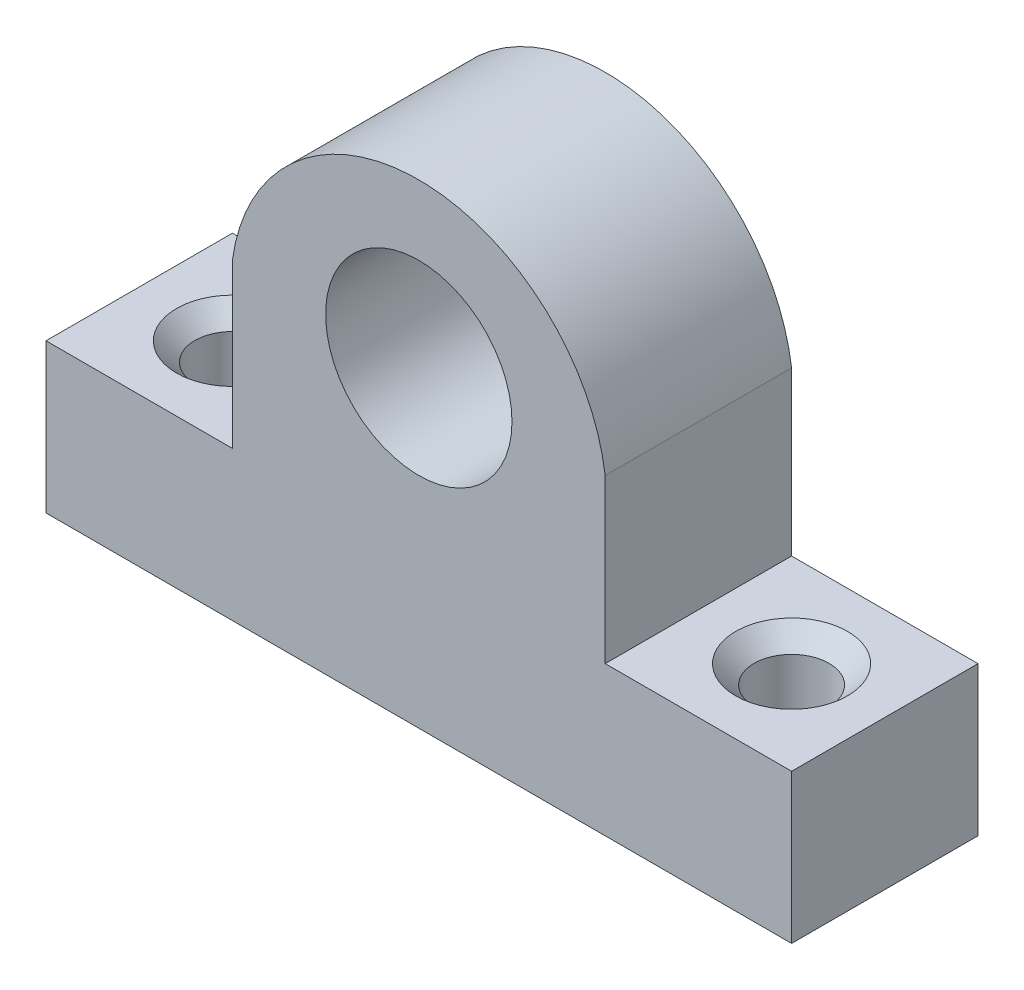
ISO-10303-21;
HEADER;
FILE_DESCRIPTION(('STEP AP214'),'2;1');
FILE_NAME('part.step','',(''),(''),'','','');
FILE_SCHEMA(('AUTOMOTIVE_DESIGN { 1 0 10303 214 1 1 1 1 }'));
ENDSEC;
DATA;
#1=APPLICATION_CONTEXT('core data for automotive mechanical design processes');
#2=APPLICATION_PROTOCOL_DEFINITION('international standard','automotive_design',2000,#1);
#3=PRODUCT_CONTEXT('',#1,'mechanical');
#4=PRODUCT('Part','Part','',(#3));
#5=PRODUCT_RELATED_PRODUCT_CATEGORY('part','',(#4));
#6=PRODUCT_DEFINITION_FORMATION('','',#4);
#7=PRODUCT_DEFINITION_CONTEXT('part definition',#1,'design');
#8=PRODUCT_DEFINITION('design','',#6,#7);
#9=PRODUCT_DEFINITION_SHAPE('','',#8);
#10=(LENGTH_UNIT() NAMED_UNIT(*) SI_UNIT(.MILLI.,.METRE.));
#11=(NAMED_UNIT(*) PLANE_ANGLE_UNIT() SI_UNIT($,.RADIAN.));
#12=(NAMED_UNIT(*) SI_UNIT($,.STERADIAN.) SOLID_ANGLE_UNIT());
#13=UNCERTAINTY_MEASURE_WITH_UNIT(LENGTH_MEASURE(1.E-05),#10,'distance_accuracy_value','');
#14=(GEOMETRIC_REPRESENTATION_CONTEXT(3) GLOBAL_UNCERTAINTY_ASSIGNED_CONTEXT((#13)) GLOBAL_UNIT_ASSIGNED_CONTEXT((#10,
#11,#12)) REPRESENTATION_CONTEXT('',''));
#15=CARTESIAN_POINT('',(0.,0.,0.));
#16=DIRECTION('',(0.,0.,1.));
#17=DIRECTION('',(1.,0.,0.));
#18=AXIS2_PLACEMENT_3D('',#15,#16,#17);
#19=CARTESIAN_POINT('',(0.,0.,12.7));
#20=DIRECTION('',(0.,1.,0.));
#21=DIRECTION('',(-1.,0.,0.));
#22=AXIS2_PLACEMENT_3D('',#19,#20,#21);
#23=PLANE('',#22);
#24=CARTESIAN_POINT('',(44.45,0.,6.35));
#25=DIRECTION('',(0.,1.,0.));
#26=DIRECTION('',(0.,0.,1.));
#27=AXIS2_PLACEMENT_3D('',#24,#25,#26);
#28=CIRCLE('',#27,2.5527);
#29=CARTESIAN_POINT('',(44.45,0.,8.9027));
#30=VERTEX_POINT('',#29);
#31=EDGE_CURVE('E304',#30,#30,#28,.T.);
#32=ORIENTED_EDGE('',*,*,#31,.T.);
#33=EDGE_LOOP('',(#32));
#34=FACE_BOUND('',#33,.T.);
#35=CARTESIAN_POINT('',(6.35000000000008,0.,6.35000000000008));
#36=DIRECTION('',(0.,1.,0.));
#37=DIRECTION('',(0.,0.,1.));
#38=AXIS2_PLACEMENT_3D('',#35,#36,#37);
#39=CIRCLE('',#38,2.5527);
#40=CARTESIAN_POINT('',(6.35000000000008,0.,8.90270000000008));
#41=VERTEX_POINT('',#40);
#42=EDGE_CURVE('E317',#41,#41,#39,.T.);
#43=ORIENTED_EDGE('',*,*,#42,.T.);
#44=EDGE_LOOP('',(#43));
#45=FACE_BOUND('',#44,.T.);
#46=DIRECTION('',(1.,0.,0.));
#47=VECTOR('',#46,1.);
#48=CARTESIAN_POINT('',(0.,0.,0.));
#49=LINE('',#48,#47);
#50=CARTESIAN_POINT('',(0.,0.,0.));
#51=VERTEX_POINT('',#50);
#52=CARTESIAN_POINT('',(50.8,0.,0.));
#53=VERTEX_POINT('',#52);
#54=EDGE_CURVE('E218',#51,#53,#49,.T.);
#55=ORIENTED_EDGE('',*,*,#54,.T.);
#56=DIRECTION('',(0.,0.,-1.));
#57=VECTOR('',#56,1.);
#58=CARTESIAN_POINT('',(50.8,0.,12.7));
#59=LINE('',#58,#57);
#60=CARTESIAN_POINT('',(50.8,0.,12.7));
#61=VERTEX_POINT('',#60);
#62=EDGE_CURVE('E191',#61,#53,#59,.T.);
#63=ORIENTED_EDGE('',*,*,#62,.F.);
#64=DIRECTION('',(1.,0.,0.));
#65=VECTOR('',#64,1.);
#66=CARTESIAN_POINT('',(0.,0.,12.7));
#67=LINE('',#66,#65);
#68=CARTESIAN_POINT('',(0.,0.,12.7));
#69=VERTEX_POINT('',#68);
#70=EDGE_CURVE('E206',#69,#61,#67,.T.);
#71=ORIENTED_EDGE('',*,*,#70,.F.);
#72=DIRECTION('',(0.,0.,-1.));
#73=VECTOR('',#72,1.);
#74=CARTESIAN_POINT('',(0.,0.,12.7));
#75=LINE('',#74,#73);
#76=EDGE_CURVE('E185',#69,#51,#75,.T.);
#77=ORIENTED_EDGE('',*,*,#76,.T.);
#78=EDGE_LOOP('',(#55,#63,#71,#77));
#79=FACE_BOUND('',#78,.T.);
#80=ADVANCED_FACE('F73',(#34,#45,#79),#23,.F.);
#81=CARTESIAN_POINT('',(50.8,0.,12.7));
#82=DIRECTION('',(-1.,0.,0.));
#83=DIRECTION('',(0.,0.,1.));
#84=AXIS2_PLACEMENT_3D('',#81,#82,#83);
#85=PLANE('',#84);
#86=DIRECTION('',(0.,1.,0.));
#87=VECTOR('',#86,1.);
#88=CARTESIAN_POINT('',(50.8,0.,0.));
#89=LINE('',#88,#87);
#90=CARTESIAN_POINT('',(50.8,10.16,0.));
#91=VERTEX_POINT('',#90);
#92=EDGE_CURVE('E216',#53,#91,#89,.T.);
#93=ORIENTED_EDGE('',*,*,#92,.T.);
#94=DIRECTION('',(0.,0.,-1.));
#95=VECTOR('',#94,1.);
#96=CARTESIAN_POINT('',(50.8,10.16,12.7));
#97=LINE('',#96,#95);
#98=CARTESIAN_POINT('',(50.8,10.16,12.7));
#99=VERTEX_POINT('',#98);
#100=EDGE_CURVE('E199',#99,#91,#97,.T.);
#101=ORIENTED_EDGE('',*,*,#100,.F.);
#102=DIRECTION('',(0.,1.,0.));
#103=VECTOR('',#102,1.);
#104=CARTESIAN_POINT('',(50.8,0.,12.7));
#105=LINE('',#104,#103);
#106=EDGE_CURVE('E210',#61,#99,#105,.T.);
#107=ORIENTED_EDGE('',*,*,#106,.F.);
#108=ORIENTED_EDGE('',*,*,#62,.T.);
#109=EDGE_LOOP('',(#93,#101,#107,#108));
#110=FACE_BOUND('',#109,.T.);
#111=ADVANCED_FACE('F237',(#110),#85,.F.);
#112=CARTESIAN_POINT('',(0.,0.,12.7));
#113=DIRECTION('',(-1.,0.,0.));
#114=DIRECTION('',(0.,0.,1.));
#115=AXIS2_PLACEMENT_3D('',#112,#113,#114);
#116=PLANE('',#115);
#117=DIRECTION('',(0.,1.,0.));
#118=VECTOR('',#117,1.);
#119=CARTESIAN_POINT('',(0.,0.,0.));
#120=LINE('',#119,#118);
#121=CARTESIAN_POINT('',(0.,10.16,0.));
#122=VERTEX_POINT('',#121);
#123=EDGE_CURVE('E194',#51,#122,#120,.T.);
#124=ORIENTED_EDGE('',*,*,#123,.F.);
#125=ORIENTED_EDGE('',*,*,#76,.F.);
#126=DIRECTION('',(0.,1.,0.));
#127=VECTOR('',#126,1.);
#128=CARTESIAN_POINT('',(0.,0.,12.7));
#129=LINE('',#128,#127);
#130=CARTESIAN_POINT('',(0.,10.16,12.7));
#131=VERTEX_POINT('',#130);
#132=EDGE_CURVE('E202',#69,#131,#129,.T.);
#133=ORIENTED_EDGE('',*,*,#132,.T.);
#134=DIRECTION('',(0.,0.,-1.));
#135=VECTOR('',#134,1.);
#136=CARTESIAN_POINT('',(0.,10.16,12.7));
#137=LINE('',#136,#135);
#138=EDGE_CURVE('E181',#131,#122,#137,.T.);
#139=ORIENTED_EDGE('',*,*,#138,.T.);
#140=EDGE_LOOP('',(#124,#125,#133,#139));
#141=FACE_BOUND('',#140,.T.);
#142=ADVANCED_FACE('F261',(#141),#116,.T.);
#143=CARTESIAN_POINT('',(0.,0.,0.));
#144=DIRECTION('',(0.,0.,1.));
#145=DIRECTION('',(1.,0.,0.));
#146=AXIS2_PLACEMENT_3D('',#143,#144,#145);
#147=PLANE('',#146);
#148=CARTESIAN_POINT('',(25.4,21.2598,0.));
#149=DIRECTION('',(0.,0.,1.));
#150=DIRECTION('',(1.,0.,0.));
#151=AXIS2_PLACEMENT_3D('',#148,#149,#150);
#152=CIRCLE('',#151,6.35);
#153=CARTESIAN_POINT('',(31.75,21.2598,0.));
#154=VERTEX_POINT('',#153);
#155=EDGE_CURVE('E321',#154,#154,#152,.T.);
#156=ORIENTED_EDGE('',*,*,#155,.T.);
#157=EDGE_LOOP('',(#156));
#158=FACE_BOUND('',#157,.T.);
#159=DIRECTION('',(0.,1.,0.));
#160=VECTOR('',#159,1.);
#161=CARTESIAN_POINT('',(12.7,10.16,0.));
#162=LINE('',#161,#160);
#163=CARTESIAN_POINT('',(12.7,10.16,0.));
#164=VERTEX_POINT('',#163);
#165=CARTESIAN_POINT('',(12.7,21.2598,0.));
#166=VERTEX_POINT('',#165);
#167=EDGE_CURVE('E167',#164,#166,#162,.T.);
#168=ORIENTED_EDGE('',*,*,#167,.T.);
#169=CARTESIAN_POINT('',(25.4,19.5442537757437,0.));
#170=DIRECTION('',(0.,0.,-1.));
#171=DIRECTION('',(-1.,0.,0.));
#172=AXIS2_PLACEMENT_3D('',#169,#170,#171);
#173=CIRCLE('',#172,12.8153462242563);
#174=CARTESIAN_POINT('',(38.1,21.2598,0.));
#175=VERTEX_POINT('',#174);
#176=EDGE_CURVE('E140',#166,#175,#173,.T.);
#177=ORIENTED_EDGE('',*,*,#176,.T.);
#178=DIRECTION('',(0.,1.,0.));
#179=VECTOR('',#178,1.);
#180=CARTESIAN_POINT('',(38.1,10.16,0.));
#181=LINE('',#180,#179);
#182=CARTESIAN_POINT('',(38.1,10.16,0.));
#183=VERTEX_POINT('',#182);
#184=EDGE_CURVE('E158',#183,#175,#181,.T.);
#185=ORIENTED_EDGE('',*,*,#184,.F.);
#186=DIRECTION('',(1.,0.,0.));
#187=VECTOR('',#186,1.);
#188=CARTESIAN_POINT('',(0.,10.16,0.));
#189=LINE('',#188,#187);
#190=EDGE_CURVE('E162',#183,#91,#189,.T.);
#191=ORIENTED_EDGE('',*,*,#190,.T.);
#192=ORIENTED_EDGE('',*,*,#92,.F.);
#193=ORIENTED_EDGE('',*,*,#54,.F.);
#194=ORIENTED_EDGE('',*,*,#123,.T.);
#195=EDGE_CURVE('E165',#122,#164,#189,.T.);
#196=ORIENTED_EDGE('',*,*,#195,.T.);
#197=EDGE_LOOP('',(#168,#177,#185,#191,#192,#193,#194,#196));
#198=FACE_BOUND('',#197,.T.);
#199=ADVANCED_FACE('F239',(#158,#198),#147,.F.);
#200=CARTESIAN_POINT('',(0.,0.,12.7));
#201=DIRECTION('',(0.,0.,1.));
#202=DIRECTION('',(1.,0.,0.));
#203=AXIS2_PLACEMENT_3D('',#200,#201,#202);
#204=PLANE('',#203);
#205=CARTESIAN_POINT('',(25.4,21.2598,12.7));
#206=DIRECTION('',(0.,0.,1.));
#207=DIRECTION('',(1.,0.,0.));
#208=AXIS2_PLACEMENT_3D('',#205,#206,#207);
#209=CIRCLE('',#208,6.35);
#210=CARTESIAN_POINT('',(31.75,21.2598,12.7));
#211=VERTEX_POINT('',#210);
#212=EDGE_CURVE('E77',#211,#211,#209,.T.);
#213=ORIENTED_EDGE('',*,*,#212,.F.);
#214=EDGE_LOOP('',(#213));
#215=FACE_BOUND('',#214,.T.);
#216=CARTESIAN_POINT('',(25.4,19.5442537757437,12.7));
#217=DIRECTION('',(0.,0.,1.));
#218=DIRECTION('',(1.,0.,0.));
#219=AXIS2_PLACEMENT_3D('',#216,#217,#218);
#220=CIRCLE('',#219,12.8153462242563);
#221=CARTESIAN_POINT('',(12.7,21.2598,12.700006));
#222=VERTEX_POINT('',#221);
#223=CARTESIAN_POINT('',(38.1,21.2598,12.7));
#224=VERTEX_POINT('',#223);
#225=EDGE_CURVE('E91',#222,#224,#220,.F.);
#226=ORIENTED_EDGE('',*,*,#225,.F.);
#227=DIRECTION('',(0.,1.,0.));
#228=VECTOR('',#227,1.);
#229=CARTESIAN_POINT('',(12.7,10.16,12.7));
#230=LINE('',#229,#228);
#231=CARTESIAN_POINT('',(12.7,10.16,12.7));
#232=VERTEX_POINT('',#231);
#233=EDGE_CURVE('E153',#232,#222,#230,.T.);
#234=ORIENTED_EDGE('',*,*,#233,.F.);
#235=DIRECTION('',(1.,0.,0.));
#236=VECTOR('',#235,1.);
#237=CARTESIAN_POINT('',(0.,10.16,12.7));
#238=LINE('',#237,#236);
#239=EDGE_CURVE('E228',#131,#232,#238,.T.);
#240=ORIENTED_EDGE('',*,*,#239,.F.);
#241=ORIENTED_EDGE('',*,*,#132,.F.);
#242=ORIENTED_EDGE('',*,*,#70,.T.);
#243=ORIENTED_EDGE('',*,*,#106,.T.);
#244=CARTESIAN_POINT('',(38.1,10.16,12.7));
#245=VERTEX_POINT('',#244);
#246=EDGE_CURVE('E225',#245,#99,#238,.T.);
#247=ORIENTED_EDGE('',*,*,#246,.F.);
#248=DIRECTION('',(0.,1.,0.));
#249=VECTOR('',#248,1.);
#250=CARTESIAN_POINT('',(38.1,10.16,12.7));
#251=LINE('',#250,#249);
#252=EDGE_CURVE('E156',#245,#224,#251,.T.);
#253=ORIENTED_EDGE('',*,*,#252,.T.);
#254=EDGE_LOOP('',(#226,#234,#240,#241,#242,#243,#247,#253));
#255=FACE_BOUND('',#254,.T.);
#256=ADVANCED_FACE('F151',(#215,#255),#204,.T.);
#257=CARTESIAN_POINT('',(0.,10.16,12.7));
#258=DIRECTION('',(0.,1.,0.));
#259=DIRECTION('',(-1.,0.,0.));
#260=AXIS2_PLACEMENT_3D('',#257,#258,#259);
#261=PLANE('',#260);
#262=CARTESIAN_POINT('',(6.35000000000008,10.16,6.35000000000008));
#263=DIRECTION('',(0.,1.,0.));
#264=DIRECTION('',(0.,0.,1.));
#265=AXIS2_PLACEMENT_3D('',#262,#263,#264);
#266=CIRCLE('',#265,3.81);
#267=CARTESIAN_POINT('',(6.35000000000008,10.16,10.1600000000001));
#268=VERTEX_POINT('',#267);
#269=EDGE_CURVE('E309',#268,#268,#266,.T.);
#270=ORIENTED_EDGE('',*,*,#269,.F.);
#271=EDGE_LOOP('',(#270));
#272=FACE_BOUND('',#271,.T.);
#273=ORIENTED_EDGE('',*,*,#239,.T.);
#274=DIRECTION('',(0.,0.,-1.));
#275=VECTOR('',#274,1.);
#276=CARTESIAN_POINT('',(12.7,10.16,12.7));
#277=LINE('',#276,#275);
#278=EDGE_CURVE('E83',#232,#164,#277,.T.);
#279=ORIENTED_EDGE('',*,*,#278,.T.);
#280=ORIENTED_EDGE('',*,*,#195,.F.);
#281=ORIENTED_EDGE('',*,*,#138,.F.);
#282=EDGE_LOOP('',(#273,#279,#280,#281));
#283=FACE_BOUND('',#282,.T.);
#284=ADVANCED_FACE('F243',(#272,#283),#261,.T.);
#285=CARTESIAN_POINT('',(44.45,10.16,6.35));
#286=DIRECTION('',(0.,1.,0.));
#287=DIRECTION('',(0.,0.,1.));
#288=AXIS2_PLACEMENT_3D('',#285,#286,#287);
#289=CIRCLE('',#288,3.81);
#290=CARTESIAN_POINT('',(44.45,10.16,10.16));
#291=VERTEX_POINT('',#290);
#292=EDGE_CURVE('E300',#291,#291,#289,.T.);
#293=ORIENTED_EDGE('',*,*,#292,.F.);
#294=EDGE_LOOP('',(#293));
#295=FACE_BOUND('',#294,.T.);
#296=DIRECTION('',(0.,0.,-1.));
#297=VECTOR('',#296,1.);
#298=CARTESIAN_POINT('',(38.1,10.16,12.7));
#299=LINE('',#298,#297);
#300=EDGE_CURVE('E12',#245,#183,#299,.T.);
#301=ORIENTED_EDGE('',*,*,#300,.F.);
#302=ORIENTED_EDGE('',*,*,#246,.T.);
#303=ORIENTED_EDGE('',*,*,#100,.T.);
#304=ORIENTED_EDGE('',*,*,#190,.F.);
#305=EDGE_LOOP('',(#301,#302,#303,#304));
#306=FACE_BOUND('',#305,.T.);
#307=ADVANCED_FACE('F241',(#295,#306),#261,.T.);
#308=CARTESIAN_POINT('',(12.7,10.16,12.7));
#309=DIRECTION('',(-1.,0.,0.));
#310=DIRECTION('',(0.,0.,1.));
#311=AXIS2_PLACEMENT_3D('',#308,#309,#310);
#312=PLANE('',#311);
#313=DIRECTION('',(0.,0.,1.));
#314=VECTOR('',#313,1.);
#315=CARTESIAN_POINT('',(12.7,21.2598,0.));
#316=LINE('',#315,#314);
#317=EDGE_CURVE('E138',#166,#222,#316,.T.);
#318=ORIENTED_EDGE('',*,*,#317,.F.);
#319=ORIENTED_EDGE('',*,*,#167,.F.);
#320=ORIENTED_EDGE('',*,*,#278,.F.);
#321=ORIENTED_EDGE('',*,*,#233,.T.);
#322=EDGE_LOOP('',(#318,#319,#320,#321));
#323=FACE_BOUND('',#322,.T.);
#324=ADVANCED_FACE('F160',(#323),#312,.T.);
#325=CARTESIAN_POINT('',(38.1,10.16,12.7));
#326=DIRECTION('',(-1.,0.,0.));
#327=DIRECTION('',(0.,0.,1.));
#328=AXIS2_PLACEMENT_3D('',#325,#326,#327);
#329=PLANE('',#328);
#330=ORIENTED_EDGE('',*,*,#184,.T.);
#331=DIRECTION('',(0.,0.,1.));
#332=VECTOR('',#331,1.);
#333=CARTESIAN_POINT('',(38.1,21.2598,0.));
#334=LINE('',#333,#332);
#335=EDGE_CURVE('E146',#175,#224,#334,.T.);
#336=ORIENTED_EDGE('',*,*,#335,.T.);
#337=ORIENTED_EDGE('',*,*,#252,.F.);
#338=ORIENTED_EDGE('',*,*,#300,.T.);
#339=EDGE_LOOP('',(#330,#336,#337,#338));
#340=FACE_BOUND('',#339,.T.);
#341=ADVANCED_FACE('F75',(#340),#329,.F.);
#342=CARTESIAN_POINT('',(25.4,19.5442537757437,0.));
#343=DIRECTION('',(0.,0.,1.));
#344=DIRECTION('',(1.,0.,0.));
#345=AXIS2_PLACEMENT_3D('',#342,#343,#344);
#346=CYLINDRICAL_SURFACE('',#345,12.8153462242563);
#347=ORIENTED_EDGE('',*,*,#225,.T.);
#348=ORIENTED_EDGE('',*,*,#335,.F.);
#349=ORIENTED_EDGE('',*,*,#176,.F.);
#350=ORIENTED_EDGE('',*,*,#317,.T.);
#351=EDGE_LOOP('',(#347,#348,#349,#350));
#352=FACE_BOUND('',#351,.T.);
#353=ADVANCED_FACE('F139',(#352),#346,.T.);
#354=CARTESIAN_POINT('',(25.4,21.2598,-2.50000000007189E-05));
#355=DIRECTION('',(0.,0.,1.));
#356=DIRECTION('',(1.,0.,0.));
#357=AXIS2_PLACEMENT_3D('',#354,#355,#356);
#358=CYLINDRICAL_SURFACE('',#357,6.35);
#359=ORIENTED_EDGE('',*,*,#212,.T.);
#360=EDGE_LOOP('',(#359));
#361=FACE_BOUND('',#360,.T.);
#362=ORIENTED_EDGE('',*,*,#155,.F.);
#363=EDGE_LOOP('',(#362));
#364=FACE_BOUND('',#363,.T.);
#365=ADVANCED_FACE('F275',(#361,#364),#358,.F.);
#366=CARTESIAN_POINT('',(6.35000000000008,10.16,6.35000000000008));
#367=DIRECTION('',(0.,1.,0.));
#368=DIRECTION('',(0.,0.,1.));
#369=AXIS2_PLACEMENT_3D('',#366,#367,#368);
#370=CYLINDRICAL_SURFACE('',#369,2.55269999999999);
#371=ORIENTED_EDGE('',*,*,#42,.F.);
#372=EDGE_LOOP('',(#371));
#373=FACE_BOUND('',#372,.T.);
#374=CARTESIAN_POINT('',(6.35000000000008,8.9027,6.35000000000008));
#375=DIRECTION('',(0.,1.,0.));
#376=DIRECTION('',(0.,0.,1.));
#377=AXIS2_PLACEMENT_3D('',#374,#375,#376);
#378=CIRCLE('',#377,2.55269999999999);
#379=CARTESIAN_POINT('',(6.35000000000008,8.9027,8.90270000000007));
#380=VERTEX_POINT('',#379);
#381=EDGE_CURVE('E313',#380,#380,#378,.T.);
#382=ORIENTED_EDGE('',*,*,#381,.T.);
#383=EDGE_LOOP('',(#382));
#384=FACE_BOUND('',#383,.T.);
#385=ADVANCED_FACE('F277',(#373,#384),#370,.F.);
#386=CARTESIAN_POINT('',(6.35000000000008,10.16,6.35000000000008));
#387=DIRECTION('',(0.,1.,0.));
#388=DIRECTION('',(0.,0.,1.));
#389=AXIS2_PLACEMENT_3D('',#386,#387,#388);
#390=CONICAL_SURFACE('',#389,3.81,0.785398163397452);
#391=ORIENTED_EDGE('',*,*,#381,.F.);
#392=EDGE_LOOP('',(#391));
#393=FACE_BOUND('',#392,.T.);
#394=ORIENTED_EDGE('',*,*,#269,.T.);
#395=EDGE_LOOP('',(#394));
#396=FACE_BOUND('',#395,.T.);
#397=ADVANCED_FACE('F281',(#393,#396),#390,.F.);
#398=CARTESIAN_POINT('',(44.45,10.16,6.35));
#399=DIRECTION('',(0.,1.,0.));
#400=DIRECTION('',(0.,0.,1.));
#401=AXIS2_PLACEMENT_3D('',#398,#399,#400);
#402=CYLINDRICAL_SURFACE('',#401,2.55269999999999);
#403=ORIENTED_EDGE('',*,*,#31,.F.);
#404=EDGE_LOOP('',(#403));
#405=FACE_BOUND('',#404,.T.);
#406=CARTESIAN_POINT('',(44.45,8.9027,6.35));
#407=DIRECTION('',(0.,1.,0.));
#408=DIRECTION('',(0.,0.,1.));
#409=AXIS2_PLACEMENT_3D('',#406,#407,#408);
#410=CIRCLE('',#409,2.55269999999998);
#411=CARTESIAN_POINT('',(44.45,8.9027,8.90269999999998));
#412=VERTEX_POINT('',#411);
#413=EDGE_CURVE('E298',#412,#412,#410,.T.);
#414=ORIENTED_EDGE('',*,*,#413,.T.);
#415=EDGE_LOOP('',(#414));
#416=FACE_BOUND('',#415,.T.);
#417=ADVANCED_FACE('F285',(#405,#416),#402,.F.);
#418=CARTESIAN_POINT('',(44.45,10.16,6.35));
#419=DIRECTION('',(0.,1.,0.));
#420=DIRECTION('',(0.,0.,1.));
#421=AXIS2_PLACEMENT_3D('',#418,#419,#420);
#422=CONICAL_SURFACE('',#421,3.81,0.785398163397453);
#423=ORIENTED_EDGE('',*,*,#413,.F.);
#424=EDGE_LOOP('',(#423));
#425=FACE_BOUND('',#424,.T.);
#426=ORIENTED_EDGE('',*,*,#292,.T.);
#427=EDGE_LOOP('',(#426));
#428=FACE_BOUND('',#427,.T.);
#429=ADVANCED_FACE('F289',(#425,#428),#422,.F.);
#430=CLOSED_SHELL('',(#80,#111,#142,#199,#256,#284,#307,#324,#341,#353,#365,#385,#397,#417,#429));
#431=MANIFOLD_SOLID_BREP('B2',#430);
#432=ADVANCED_BREP_SHAPE_REPRESENTATION('',(#18,#431),#14);
#433=SHAPE_DEFINITION_REPRESENTATION(#9,#432);
ENDSEC;
END-ISO-10303-21;
